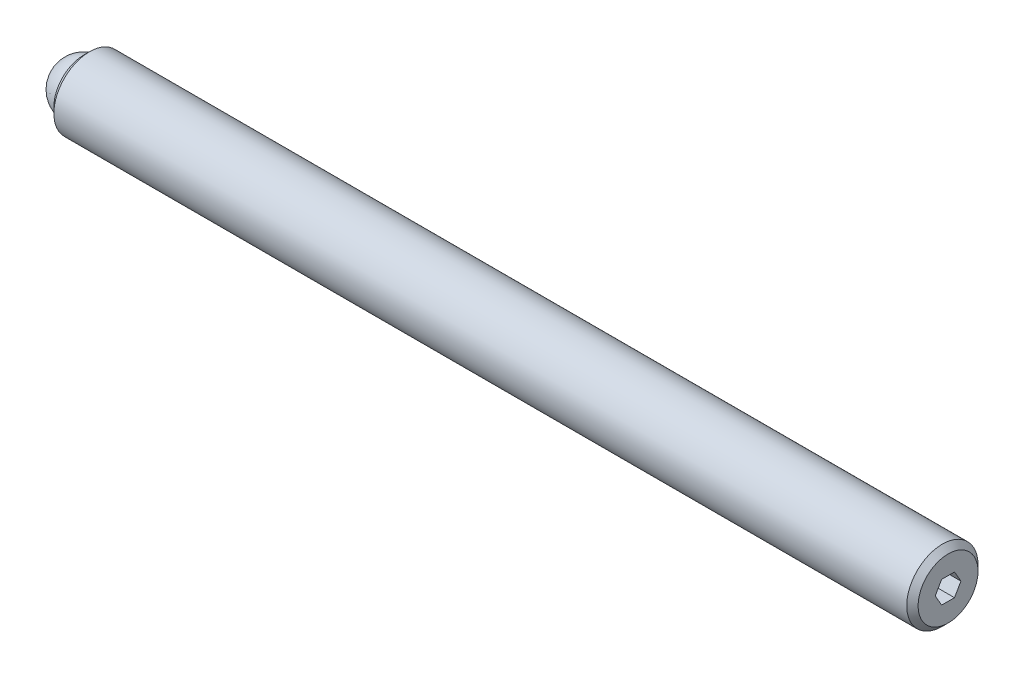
ISO-10303-21;
HEADER;
FILE_DESCRIPTION(('STEP AP214'),'2;1');
FILE_NAME('part.step','',(''),(''),'','','');
FILE_SCHEMA(('AUTOMOTIVE_DESIGN { 1 0 10303 214 1 1 1 1 }'));
ENDSEC;
DATA;
#1=APPLICATION_CONTEXT('core data for automotive mechanical design processes');
#2=APPLICATION_PROTOCOL_DEFINITION('international standard','automotive_design',2000,#1);
#3=PRODUCT_CONTEXT('',#1,'mechanical');
#4=PRODUCT('Part','Part','',(#3));
#5=PRODUCT_RELATED_PRODUCT_CATEGORY('part','',(#4));
#6=PRODUCT_DEFINITION_FORMATION('','',#4);
#7=PRODUCT_DEFINITION_CONTEXT('part definition',#1,'design');
#8=PRODUCT_DEFINITION('design','',#6,#7);
#9=PRODUCT_DEFINITION_SHAPE('','',#8);
#10=(LENGTH_UNIT() NAMED_UNIT(*) SI_UNIT(.MILLI.,.METRE.));
#11=(NAMED_UNIT(*) PLANE_ANGLE_UNIT() SI_UNIT($,.RADIAN.));
#12=(NAMED_UNIT(*) SI_UNIT($,.STERADIAN.) SOLID_ANGLE_UNIT());
#13=UNCERTAINTY_MEASURE_WITH_UNIT(LENGTH_MEASURE(1.E-05),#10,'distance_accuracy_value','');
#14=(GEOMETRIC_REPRESENTATION_CONTEXT(3) GLOBAL_UNCERTAINTY_ASSIGNED_CONTEXT((#13)) GLOBAL_UNIT_ASSIGNED_CONTEXT((#10,
#11,#12)) REPRESENTATION_CONTEXT('',''));
#15=CARTESIAN_POINT('',(0.,0.,0.));
#16=DIRECTION('',(0.,0.,1.));
#17=DIRECTION('',(1.,0.,0.));
#18=AXIS2_PLACEMENT_3D('',#15,#16,#17);
#19=CARTESIAN_POINT('',(0.,0.,0.));
#20=DIRECTION('',(0.,-1.,0.));
#21=DIRECTION('',(0.,0.,1.));
#22=AXIS2_PLACEMENT_3D('',#19,#20,#21);
#23=SPHERICAL_SURFACE('',#22,2.38125);
#24=CARTESIAN_POINT('',(0.,-2.38125,0.));
#25=VERTEX_POINT('',#24);
#26=VERTEX_LOOP('',#25);
#27=FACE_BOUND('',#26,.T.);
#28=ADVANCED_FACE('F41',(#27),#23,.T.);
#29=CLOSED_SHELL('',(#28));
#30=MANIFOLD_SOLID_BREP('B2',#29);
#31=CARTESIAN_POINT('',(76.99375,0.,0.));
#32=DIRECTION('',(-1.,0.,0.));
#33=DIRECTION('',(0.,0.,1.));
#34=AXIS2_PLACEMENT_3D('',#31,#32,#33);
#35=CYLINDRICAL_SURFACE('',#34,3.175);
#36=CARTESIAN_POINT('',(76.48575,0.,0.));
#37=DIRECTION('',(1.,0.,0.));
#38=DIRECTION('',(0.,0.,-1.));
#39=AXIS2_PLACEMENT_3D('',#36,#37,#38);
#40=CIRCLE('',#39,3.175);
#41=CARTESIAN_POINT('',(76.48575,0.,-3.175));
#42=VERTEX_POINT('',#41);
#43=EDGE_CURVE('E39',#42,#42,#40,.F.);
#44=ORIENTED_EDGE('',*,*,#43,.T.);
#45=EDGE_LOOP('',(#44));
#46=FACE_BOUND('',#45,.T.);
#47=CARTESIAN_POINT('',(0.507999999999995,0.,0.));
#48=DIRECTION('',(1.,0.,0.));
#49=DIRECTION('',(0.,0.,-1.));
#50=AXIS2_PLACEMENT_3D('',#47,#48,#49);
#51=CIRCLE('',#50,3.175);
#52=CARTESIAN_POINT('',(0.507999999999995,0.,-3.175));
#53=VERTEX_POINT('',#52);
#54=EDGE_CURVE('E157',#53,#53,#51,.T.);
#55=ORIENTED_EDGE('',*,*,#54,.T.);
#56=EDGE_LOOP('',(#55));
#57=FACE_BOUND('',#56,.T.);
#58=ADVANCED_FACE('F54',(#46,#57),#35,.T.);
#59=CARTESIAN_POINT('',(76.99375,0.,0.));
#60=DIRECTION('',(1.,0.,0.));
#61=DIRECTION('',(0.,0.,-1.));
#62=AXIS2_PLACEMENT_3D('',#59,#60,#61);
#63=PLANE('',#62);
#64=DIRECTION('',(0.,0.866025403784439,-0.5));
#65=VECTOR('',#64,1.);
#66=CARTESIAN_POINT('',(76.99375,-0.9921875,-0.572839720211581));
#67=LINE('',#66,#65);
#68=CARTESIAN_POINT('',(76.99375,-0.9921875,-0.572839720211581));
#69=VERTEX_POINT('',#68);
#70=CARTESIAN_POINT('',(76.99375,0.,-1.14567944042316));
#71=VERTEX_POINT('',#70);
#72=EDGE_CURVE('E69',#69,#71,#67,.T.);
#73=ORIENTED_EDGE('',*,*,#72,.F.);
#74=DIRECTION('',(0.,0.,-1.));
#75=VECTOR('',#74,1.);
#76=CARTESIAN_POINT('',(76.99375,-0.9921875,0.572839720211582));
#77=LINE('',#76,#75);
#78=CARTESIAN_POINT('',(76.99375,-0.9921875,0.572839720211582));
#79=VERTEX_POINT('',#78);
#80=EDGE_CURVE('E153',#79,#69,#77,.T.);
#81=ORIENTED_EDGE('',*,*,#80,.F.);
#82=DIRECTION('',(0.,-0.866025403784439,-0.5));
#83=VECTOR('',#82,1.);
#84=CARTESIAN_POINT('',(76.99375,0.,1.14567944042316));
#85=LINE('',#84,#83);
#86=CARTESIAN_POINT('',(76.99375,0.,1.14567944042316));
#87=VERTEX_POINT('',#86);
#88=EDGE_CURVE('E151',#87,#79,#85,.T.);
#89=ORIENTED_EDGE('',*,*,#88,.F.);
#90=DIRECTION('',(0.,-0.866025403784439,0.5));
#91=VECTOR('',#90,1.);
#92=CARTESIAN_POINT('',(76.99375,0.992187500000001,0.572839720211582));
#93=LINE('',#92,#91);
#94=CARTESIAN_POINT('',(76.99375,0.992187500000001,0.572839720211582));
#95=VERTEX_POINT('',#94);
#96=EDGE_CURVE('E117',#95,#87,#93,.T.);
#97=ORIENTED_EDGE('',*,*,#96,.F.);
#98=DIRECTION('',(0.,0.,1.));
#99=VECTOR('',#98,1.);
#100=CARTESIAN_POINT('',(76.99375,0.9921875,-0.572839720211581));
#101=LINE('',#100,#99);
#102=CARTESIAN_POINT('',(76.99375,0.9921875,-0.572839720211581));
#103=VERTEX_POINT('',#102);
#104=EDGE_CURVE('E147',#103,#95,#101,.T.);
#105=ORIENTED_EDGE('',*,*,#104,.F.);
#106=DIRECTION('',(0.,0.866025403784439,0.5));
#107=VECTOR('',#106,1.);
#108=CARTESIAN_POINT('',(76.99375,0.,-1.14567944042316));
#109=LINE('',#108,#107);
#110=EDGE_CURVE('E143',#71,#103,#109,.T.);
#111=ORIENTED_EDGE('',*,*,#110,.F.);
#112=EDGE_LOOP('',(#73,#81,#89,#97,#105,#111));
#113=FACE_BOUND('',#112,.T.);
#114=CARTESIAN_POINT('',(76.99375,0.,0.));
#115=DIRECTION('',(1.,0.,0.));
#116=DIRECTION('',(0.,0.,-1.));
#117=AXIS2_PLACEMENT_3D('',#114,#115,#116);
#118=CIRCLE('',#117,2.66700000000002);
#119=CARTESIAN_POINT('',(76.99375,0.,-2.66700000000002));
#120=VERTEX_POINT('',#119);
#121=EDGE_CURVE('E62',#120,#120,#118,.T.);
#122=ORIENTED_EDGE('',*,*,#121,.T.);
#123=EDGE_LOOP('',(#122));
#124=FACE_BOUND('',#123,.T.);
#125=ADVANCED_FACE('F170',(#113,#124),#63,.T.);
#126=CARTESIAN_POINT('',(0.,0.,0.));
#127=DIRECTION('',(1.,0.,0.));
#128=DIRECTION('',(0.,0.,-1.));
#129=AXIS2_PLACEMENT_3D('',#126,#127,#128);
#130=PLANE('',#129);
#131=CARTESIAN_POINT('',(0.,0.,0.));
#132=DIRECTION('',(-1.,0.,0.));
#133=DIRECTION('',(0.,0.,1.));
#134=AXIS2_PLACEMENT_3D('',#131,#132,#133);
#135=CIRCLE('',#134,2.38125);
#136=CARTESIAN_POINT('',(0.,0.,2.38125));
#137=VERTEX_POINT('',#136);
#138=EDGE_CURVE('E225',#137,#137,#135,.T.);
#139=ORIENTED_EDGE('',*,*,#138,.F.);
#140=EDGE_LOOP('',(#139));
#141=FACE_BOUND('',#140,.T.);
#142=CARTESIAN_POINT('',(0.,0.,0.));
#143=DIRECTION('',(1.,0.,0.));
#144=DIRECTION('',(0.,0.,-1.));
#145=AXIS2_PLACEMENT_3D('',#142,#143,#144);
#146=CIRCLE('',#145,2.667);
#147=CARTESIAN_POINT('',(0.,0.,-2.667));
#148=VERTEX_POINT('',#147);
#149=EDGE_CURVE('E165',#148,#148,#146,.F.);
#150=ORIENTED_EDGE('',*,*,#149,.T.);
#151=EDGE_LOOP('',(#150));
#152=FACE_BOUND('',#151,.T.);
#153=ADVANCED_FACE('F182',(#141,#152),#130,.F.);
#154=CARTESIAN_POINT('',(0.507999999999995,0.,0.));
#155=DIRECTION('',(1.,0.,0.));
#156=DIRECTION('',(0.,0.,-1.));
#157=AXIS2_PLACEMENT_3D('',#154,#155,#156);
#158=CONICAL_SURFACE('',#157,3.175,0.785398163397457);
#159=ORIENTED_EDGE('',*,*,#149,.F.);
#160=EDGE_LOOP('',(#159));
#161=FACE_BOUND('',#160,.T.);
#162=ORIENTED_EDGE('',*,*,#54,.F.);
#163=EDGE_LOOP('',(#162));
#164=FACE_BOUND('',#163,.T.);
#165=ADVANCED_FACE('F174',(#161,#164),#158,.T.);
#166=CARTESIAN_POINT('',(76.99375,0.,0.));
#167=DIRECTION('',(-1.,0.,0.));
#168=DIRECTION('',(0.,0.,1.));
#169=AXIS2_PLACEMENT_3D('',#166,#167,#168);
#170=CONICAL_SURFACE('',#169,2.66700000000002,0.785398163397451);
#171=ORIENTED_EDGE('',*,*,#43,.F.);
#172=EDGE_LOOP('',(#171));
#173=FACE_BOUND('',#172,.T.);
#174=ORIENTED_EDGE('',*,*,#121,.F.);
#175=EDGE_LOOP('',(#174));
#176=FACE_BOUND('',#175,.T.);
#177=ADVANCED_FACE('F56',(#173,#176),#170,.T.);
#178=CARTESIAN_POINT('',(74.70775,-0.9921875,-0.572839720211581));
#179=DIRECTION('',(0.,-0.5,-0.866025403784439));
#180=DIRECTION('',(0.,0.866025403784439,-0.5));
#181=AXIS2_PLACEMENT_3D('',#178,#179,#180);
#182=PLANE('',#181);
#183=ORIENTED_EDGE('',*,*,#72,.T.);
#184=DIRECTION('',(1.,0.,0.));
#185=VECTOR('',#184,1.);
#186=CARTESIAN_POINT('',(74.70775,0.,-1.14567944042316));
#187=LINE('',#186,#185);
#188=CARTESIAN_POINT('',(74.70775,0.,-1.14567944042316));
#189=VERTEX_POINT('',#188);
#190=EDGE_CURVE('E99',#189,#71,#187,.T.);
#191=ORIENTED_EDGE('',*,*,#190,.F.);
#192=DIRECTION('',(0.,0.866025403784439,-0.5));
#193=VECTOR('',#192,1.);
#194=CARTESIAN_POINT('',(74.70775,-0.9921875,-0.572839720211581));
#195=LINE('',#194,#193);
#196=CARTESIAN_POINT('',(74.70775,-0.9921875,-0.572839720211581));
#197=VERTEX_POINT('',#196);
#198=EDGE_CURVE('E155',#197,#189,#195,.T.);
#199=ORIENTED_EDGE('',*,*,#198,.F.);
#200=DIRECTION('',(1.,0.,0.));
#201=VECTOR('',#200,1.);
#202=CARTESIAN_POINT('',(74.70775,-0.9921875,-0.572839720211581));
#203=LINE('',#202,#201);
#204=EDGE_CURVE('E77',#197,#69,#203,.T.);
#205=ORIENTED_EDGE('',*,*,#204,.T.);
#206=EDGE_LOOP('',(#183,#191,#199,#205));
#207=FACE_BOUND('',#206,.T.);
#208=ADVANCED_FACE('F173',(#207),#182,.F.);
#209=CARTESIAN_POINT('',(74.70775,-0.9921875,0.572839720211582));
#210=DIRECTION('',(0.,-1.,0.));
#211=DIRECTION('',(0.,0.,-1.));
#212=AXIS2_PLACEMENT_3D('',#209,#210,#211);
#213=PLANE('',#212);
#214=ORIENTED_EDGE('',*,*,#80,.T.);
#215=ORIENTED_EDGE('',*,*,#204,.F.);
#216=DIRECTION('',(0.,0.,-1.));
#217=VECTOR('',#216,1.);
#218=CARTESIAN_POINT('',(74.70775,-0.9921875,0.572839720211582));
#219=LINE('',#218,#217);
#220=CARTESIAN_POINT('',(74.70775,-0.9921875,0.572839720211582));
#221=VERTEX_POINT('',#220);
#222=EDGE_CURVE('E129',#221,#197,#219,.T.);
#223=ORIENTED_EDGE('',*,*,#222,.F.);
#224=DIRECTION('',(1.,0.,0.));
#225=VECTOR('',#224,1.);
#226=CARTESIAN_POINT('',(74.70775,-0.9921875,0.572839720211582));
#227=LINE('',#226,#225);
#228=EDGE_CURVE('E121',#221,#79,#227,.T.);
#229=ORIENTED_EDGE('',*,*,#228,.T.);
#230=EDGE_LOOP('',(#214,#215,#223,#229));
#231=FACE_BOUND('',#230,.T.);
#232=ADVANCED_FACE('F180',(#231),#213,.F.);
#233=CARTESIAN_POINT('',(74.70775,0.,1.14567944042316));
#234=DIRECTION('',(0.,-0.5,0.866025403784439));
#235=DIRECTION('',(0.,-0.866025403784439,-0.5));
#236=AXIS2_PLACEMENT_3D('',#233,#234,#235);
#237=PLANE('',#236);
#238=ORIENTED_EDGE('',*,*,#88,.T.);
#239=ORIENTED_EDGE('',*,*,#228,.F.);
#240=DIRECTION('',(0.,-0.866025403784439,-0.5));
#241=VECTOR('',#240,1.);
#242=CARTESIAN_POINT('',(74.70775,0.,1.14567944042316));
#243=LINE('',#242,#241);
#244=CARTESIAN_POINT('',(74.70775,0.,1.14567944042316));
#245=VERTEX_POINT('',#244);
#246=EDGE_CURVE('E125',#245,#221,#243,.T.);
#247=ORIENTED_EDGE('',*,*,#246,.F.);
#248=DIRECTION('',(1.,0.,0.));
#249=VECTOR('',#248,1.);
#250=CARTESIAN_POINT('',(74.70775,0.,1.14567944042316));
#251=LINE('',#250,#249);
#252=EDGE_CURVE('E110',#245,#87,#251,.T.);
#253=ORIENTED_EDGE('',*,*,#252,.T.);
#254=EDGE_LOOP('',(#238,#239,#247,#253));
#255=FACE_BOUND('',#254,.T.);
#256=ADVANCED_FACE('F126',(#255),#237,.F.);
#257=CARTESIAN_POINT('',(74.70775,0.992187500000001,0.572839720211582));
#258=DIRECTION('',(0.,0.5,0.866025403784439));
#259=DIRECTION('',(0.,-0.866025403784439,0.5));
#260=AXIS2_PLACEMENT_3D('',#257,#258,#259);
#261=PLANE('',#260);
#262=ORIENTED_EDGE('',*,*,#96,.T.);
#263=ORIENTED_EDGE('',*,*,#252,.F.);
#264=DIRECTION('',(0.,-0.866025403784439,0.5));
#265=VECTOR('',#264,1.);
#266=CARTESIAN_POINT('',(74.70775,0.992187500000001,0.572839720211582));
#267=LINE('',#266,#265);
#268=CARTESIAN_POINT('',(74.70775,0.992187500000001,0.572839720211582));
#269=VERTEX_POINT('',#268);
#270=EDGE_CURVE('E114',#269,#245,#267,.T.);
#271=ORIENTED_EDGE('',*,*,#270,.F.);
#272=DIRECTION('',(1.,0.,0.));
#273=VECTOR('',#272,1.);
#274=CARTESIAN_POINT('',(74.70775,0.992187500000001,0.572839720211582));
#275=LINE('',#274,#273);
#276=EDGE_CURVE('E122',#269,#95,#275,.T.);
#277=ORIENTED_EDGE('',*,*,#276,.T.);
#278=EDGE_LOOP('',(#262,#263,#271,#277));
#279=FACE_BOUND('',#278,.T.);
#280=ADVANCED_FACE('F112',(#279),#261,.F.);
#281=CARTESIAN_POINT('',(74.70775,0.9921875,-0.572839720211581));
#282=DIRECTION('',(0.,1.,0.));
#283=DIRECTION('',(0.,0.,1.));
#284=AXIS2_PLACEMENT_3D('',#281,#282,#283);
#285=PLANE('',#284);
#286=ORIENTED_EDGE('',*,*,#104,.T.);
#287=ORIENTED_EDGE('',*,*,#276,.F.);
#288=DIRECTION('',(0.,0.,1.));
#289=VECTOR('',#288,1.);
#290=CARTESIAN_POINT('',(74.70775,0.9921875,-0.572839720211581));
#291=LINE('',#290,#289);
#292=CARTESIAN_POINT('',(74.70775,0.9921875,-0.572839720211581));
#293=VERTEX_POINT('',#292);
#294=EDGE_CURVE('E135',#293,#269,#291,.T.);
#295=ORIENTED_EDGE('',*,*,#294,.F.);
#296=DIRECTION('',(1.,0.,0.));
#297=VECTOR('',#296,1.);
#298=CARTESIAN_POINT('',(74.70775,0.9921875,-0.572839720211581));
#299=LINE('',#298,#297);
#300=EDGE_CURVE('E160',#293,#103,#299,.T.);
#301=ORIENTED_EDGE('',*,*,#300,.T.);
#302=EDGE_LOOP('',(#286,#287,#295,#301));
#303=FACE_BOUND('',#302,.T.);
#304=ADVANCED_FACE('F201',(#303),#285,.F.);
#305=CARTESIAN_POINT('',(74.70775,0.,-1.14567944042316));
#306=DIRECTION('',(0.,0.5,-0.866025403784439));
#307=DIRECTION('',(0.,0.866025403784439,0.5));
#308=AXIS2_PLACEMENT_3D('',#305,#306,#307);
#309=PLANE('',#308);
#310=ORIENTED_EDGE('',*,*,#110,.T.);
#311=ORIENTED_EDGE('',*,*,#300,.F.);
#312=DIRECTION('',(0.,0.866025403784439,0.5));
#313=VECTOR('',#312,1.);
#314=CARTESIAN_POINT('',(74.70775,0.,-1.14567944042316));
#315=LINE('',#314,#313);
#316=EDGE_CURVE('E137',#189,#293,#315,.T.);
#317=ORIENTED_EDGE('',*,*,#316,.F.);
#318=ORIENTED_EDGE('',*,*,#190,.T.);
#319=EDGE_LOOP('',(#310,#311,#317,#318));
#320=FACE_BOUND('',#319,.T.);
#321=ADVANCED_FACE('F198',(#320),#309,.F.);
#322=CARTESIAN_POINT('',(74.70775,0.,0.));
#323=DIRECTION('',(1.,0.,0.));
#324=DIRECTION('',(0.,0.,-1.));
#325=AXIS2_PLACEMENT_3D('',#322,#323,#324);
#326=PLANE('',#325);
#327=ORIENTED_EDGE('',*,*,#198,.T.);
#328=ORIENTED_EDGE('',*,*,#316,.T.);
#329=ORIENTED_EDGE('',*,*,#294,.T.);
#330=ORIENTED_EDGE('',*,*,#270,.T.);
#331=ORIENTED_EDGE('',*,*,#246,.T.);
#332=ORIENTED_EDGE('',*,*,#222,.T.);
#333=EDGE_LOOP('',(#327,#328,#329,#330,#331,#332));
#334=FACE_BOUND('',#333,.T.);
#335=ADVANCED_FACE('F132',(#334),#326,.T.);
#336=CARTESIAN_POINT('',(1.984375,0.,0.));
#337=DIRECTION('',(-1.,0.,0.));
#338=DIRECTION('',(0.,0.,1.));
#339=AXIS2_PLACEMENT_3D('',#336,#337,#338);
#340=CYLINDRICAL_SURFACE('',#339,2.38125);
#341=CARTESIAN_POINT('',(1.984375,0.,0.));
#342=DIRECTION('',(-1.,0.,0.));
#343=DIRECTION('',(0.,0.,1.));
#344=AXIS2_PLACEMENT_3D('',#341,#342,#343);
#345=CIRCLE('',#344,2.38125);
#346=CARTESIAN_POINT('',(1.984375,0.,2.38125));
#347=VERTEX_POINT('',#346);
#348=EDGE_CURVE('E144',#347,#347,#345,.T.);
#349=ORIENTED_EDGE('',*,*,#348,.F.);
#350=EDGE_LOOP('',(#349));
#351=FACE_BOUND('',#350,.T.);
#352=ORIENTED_EDGE('',*,*,#138,.T.);
#353=EDGE_LOOP('',(#352));
#354=FACE_BOUND('',#353,.T.);
#355=ADVANCED_FACE('F214',(#351,#354),#340,.F.);
#356=CARTESIAN_POINT('',(1.984375,0.,0.));
#357=DIRECTION('',(-1.,0.,0.));
#358=DIRECTION('',(0.,0.,1.));
#359=AXIS2_PLACEMENT_3D('',#356,#357,#358);
#360=PLANE('',#359);
#361=ORIENTED_EDGE('',*,*,#348,.T.);
#362=EDGE_LOOP('',(#361));
#363=FACE_BOUND('',#362,.T.);
#364=ADVANCED_FACE('F217',(#363),#360,.T.);
#365=CLOSED_SHELL('',(#58,#125,#153,#165,#177,#208,#232,#256,#280,#304,#321,#335,#355,#364));
#366=MANIFOLD_SOLID_BREP('B6',#365);
#367=ADVANCED_BREP_SHAPE_REPRESENTATION('',(#18,#30,#366),#14);
#368=SHAPE_DEFINITION_REPRESENTATION(#9,#367);
ENDSEC;
END-ISO-10303-21;
